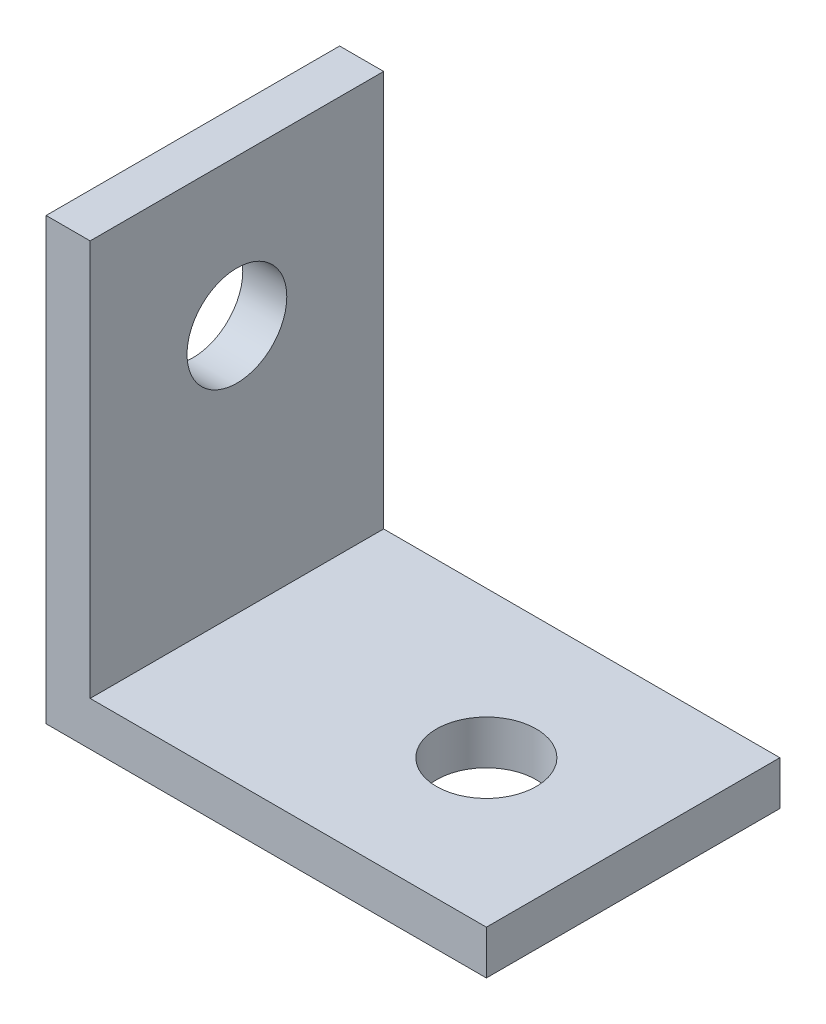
from build123d import *

# Parameters (mm, degrees)
SKETCH_1_W              = 15
SKETCH_1_H              = 15
EXTRUDE_1_DEPTH         = 10
SKETCH_2_W              = 27
SKETCH_2_H              = 27
CUT_EXTRUDE_1_DEPTH     = 10
HOLE_WIZARD_3_4_3_4_1_D = 3.4
HOLE_WIZARD_3_4_3_4_2_D = 3.4


with BuildPart() as part:
    # Sketch 1 → Extrude 1 (new body)
    with BuildSketch(Plane.XY):
        Rectangle(SKETCH_1_W, SKETCH_1_H)
    extrude(amount=EXTRUDE_1_DEPTH)

    # Sketch 2 → Cut-Extrude 1 (cut)
    with BuildSketch(Plane.XY.offset(10)):
        with Locations((7.5, 7.5)):
            Rectangle(SKETCH_2_W, SKETCH_2_H)
    extrude(amount=-CUT_EXTRUDE_1_DEPTH, mode=Mode.SUBTRACT)

    # Hole Wizard 3.4 _3.4_ _1 (through all)
    with Locations(Plane(origin=(-6, 0, 0), x_dir=(0, 0, -1), z_dir=(1, 0, 0))):
        with Locations((-5, 2.5)):
            Hole(HOLE_WIZARD_3_4_3_4_1_D / 2)

    # Hole Wizard 3.4 _3.4_ _2 (through all)
    with Locations(Plane(origin=(0, -6, 0), x_dir=(1, 0, 0), z_dir=(0, 1, 0))):
        with Locations((2.5, -5)):
            Hole(HOLE_WIZARD_3_4_3_4_2_D / 2)


solid = part.part
